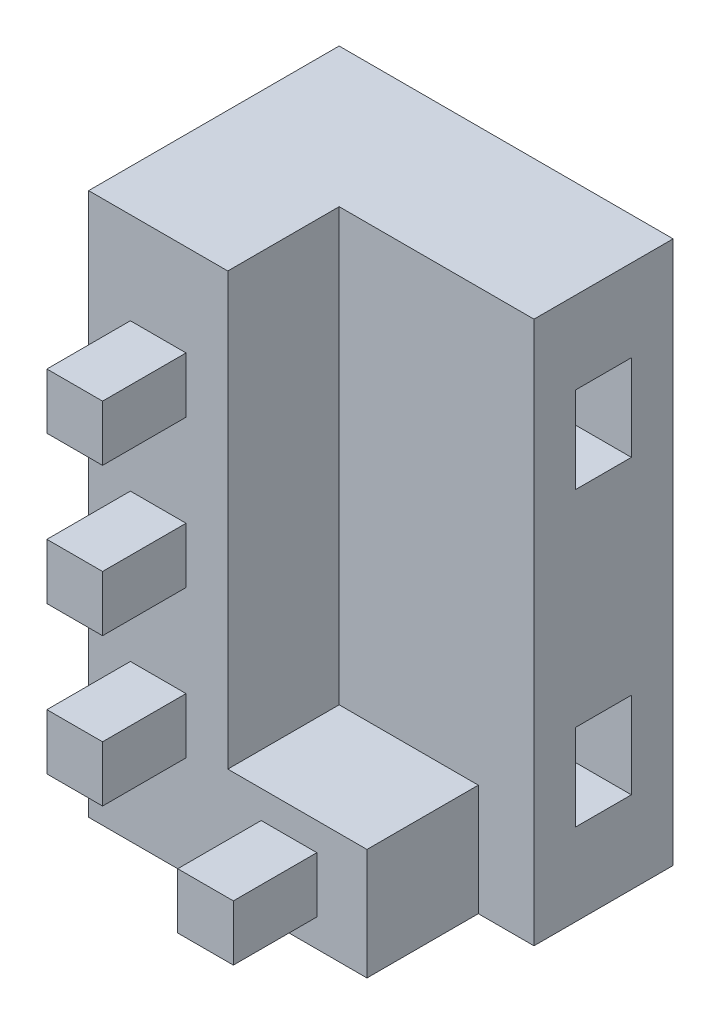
from build123d import *

# Parameters (mm, degrees)
SKETCH1_W                = 50
SKETCH1_H                = 150
BOSS_EXTRUDE1_DEPTH      = 250
SKETCH2_R                = 52.5
CUT_EXTRUDE1_DEPTH       = 15
BOSS_EXTRUDE2_DEPTH      = 150
BOSS_EXTRUDE3_DEPTH      = 175
SKETCH10_W               = 49.988184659
SKETCH10_H               = 250
BOSS_EXTRUDE4_DEPTH      = 200
CUT_EXTRUDE4_DEPTH       = 471.132959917
SKETCH12_W               = 200
SKETCH12_H               = 49.988184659
CUT_EXTRUDE5_DEPTH       = 55
CUT_EXTRUDE8_DEPTH       = 20
SKETCH17_W               = 12.5
SKETCH17_H               = 10.5
CUT_EXTRUDE9_DEPTH       = 9
SKETCH20_R               = 54.5
CUT_EXTRUDE10_DEPTH      = 10
SKETCH21_W               = 182.056865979
SKETCH21_H               = 55
CUT_EXTRUDE11_DEPTH      = 457.207189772
SKETCH24_W               = 16.5
SKETCH24_H               = 16.5
CUT_EXTRUDE13_DEPTH      = 50
SKETCH25_W               = 16.5
SKETCH25_H               = 22
CUT_EXTRUDE14_DEPTH      = 50
SKETCH26_W               = 16.5
SKETCH26_H               = 6.313729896
CUT_EXTRUDE15_DEPTH      = 50
CUT_EXTRUDE16_START      = -71.75
CUT_EXTRUDE16_DEPTH      = 29
SKETCH29_W               = 12.5
SKETCH29_H               = 10.8
CUT_EXTRUDE18_DEPTH      = 9
SKETCH30_W               = 40.672773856
SKETCH30_H               = 32.854304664
CUT_EXTRUDE19_DEPTH      = 50
SKETCH31_R               = 3.5
CUT_EXTRUDE20_DEPTH      = 20
CUT_EXTRUDE21_DEPTH      = 33
SKETCH33_R               = 63
SKETCH33_R_2             = 60
CUT_EXTRUDE22_DEPTH      = 20
CUT_EXTRUDE24_DEPTH      = 444.339599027
CUT_EXTRUDE24_DEPTH_BACK = 444.339599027
SKETCH34_W               = 192.037708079
SKETCH34_H               = 235
CUT_EXTRUDE25_DEPTH      = 444.339599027
CUT_EXTRUDE25_DEPTH_BACK = 444.339599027
SKETCH35_W               = 71
SKETCH35_H               = 90
SKETCH35_W_2             = 71.037708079
SKETCH35_H_2             = 40.011815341
BOSS_EXTRUDE5_START      = -155
SKETCH36_W               = 50
SKETCH36_H               = 40.011815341
BOSS_EXTRUDE5_DEPTH      = 40
SKETCH37_W               = 110
SKETCH37_H               = 15
BOSS_EXTRUDE6_DEPTH      = 40
CUT_EXTRUDE26_DEPTH      = 437.949653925
CUT_EXTRUDE26_DEPTH_BACK = 437.949653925
SKETCH38_R               = 5
SKETCH39_W               = 20
SKETCH39_H               = 20
BOSS_EXTRUDE7_DEPTH      = 30
CUT_EXTRUDE27_DEPTH      = 310.558805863
CUT_EXTRUDE27_DEPTH_BACK = 310.558805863
SKETCH40_W               = 130
SKETCH40_H               = 195
CUT_EXTRUDE28_DEPTH      = 21


with BuildPart() as part:
    # Sketch1 → Boss-Extrude1 (new body)
    with BuildSketch(Plane(origin=(0, 0, 0), x_dir=(1, 0, 0), z_dir=(0, 1, 0))):
        with Locations((5, 75)):
            Rectangle(SKETCH1_W, SKETCH1_H)
    extrude(amount=BOSS_EXTRUDE1_DEPTH)

    # Sketch2 → Cut-Extrude1 (cut)
    with BuildSketch(Plane(origin=(30, 0, 0), x_dir=(0, 0, -1), z_dir=(1, 0, 0))):
        with Locations((75, 175)):
            Circle(SKETCH2_R)
    extrude(amount=-CUT_EXTRUDE1_DEPTH, mode=Mode.SUBTRACT)

    # Sketch4 → Boss-Extrude2 (add)
    with BuildSketch(Plane.XY):
        with BuildLine():
            Line((30, 0), (30, 62.5))
            ThreePointArc((30, 62.5), (53.728602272, 17.849160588), (101.037708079, 0))
            Line((101.037708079, 0), (30, 0))
        make_face()
        with BuildLine():
            Line((-20, 0), (-91, 0))
            ThreePointArc((-91, 0), (-43.705047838, 17.850934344), (-20, 62.5))
            Line((-20, 62.5), (-20, 0))
        make_face()
    extrude(amount=-BOSS_EXTRUDE2_DEPTH)

    # Sketch8 → Boss-Extrude3 (add)
    with BuildSketch(Plane(origin=(0, 0, -150), x_dir=(-1, 0, 0), z_dir=(0, 0, -1))):
        with BuildLine():
            Line((-30, 250), (-30, 62.5))
            ThreePointArc((-30, 62.5), (-53.728602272, 17.849160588), (-101.037708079, 0))
            Line((-101.037708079, 0), (91, 0))
            ThreePointArc((91, 0), (43.705047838, 17.850934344), (20, 62.5))
            Line((20, 62.5), (20, 250))
            Line((20, 250), (-30, 250))
        make_face()
    extrude(amount=BOSS_EXTRUDE3_DEPTH)

    # Sketch10 → Boss-Extrude4 (add)
    with BuildSketch(Plane(origin=(30, 0, 0), x_dir=(0, 0, -1), z_dir=(1, 0, 0))):
        with Locations((300.005907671, 125)):
            Rectangle(SKETCH10_W, SKETCH10_H)
    extrude(amount=BOSS_EXTRUDE4_DEPTH)

    # Sketch11 → Cut-Extrude4 (cut, through all)
    with BuildSketch(Plane(origin=(0, 0, -325), x_dir=(-1, 0, 0), z_dir=(0, 0, -1))):
        Polygon((-166.5, 175), (-135.5, 175), (-135.5, 154), (-197.5, 154), (-197.5, 175), align=None)
    extrude(amount=-CUT_EXTRUDE4_DEPTH, mode=Mode.SUBTRACT)

    # Sketch12 → Cut-Extrude5 (cut)
    with BuildSketch(Plane(origin=(0, 250, 0), x_dir=(1, 0, 0), z_dir=(0, 1, 0))):
        with Locations((130, 300.005907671)):
            Rectangle(SKETCH12_W, SKETCH12_H)
    extrude(amount=-CUT_EXTRUDE5_DEPTH, mode=Mode.SUBTRACT)

    # Sketch16 → Cut-Extrude8 (cut)
    with BuildSketch(Plane(origin=(15, 0, 0), x_dir=(0, 0, -1), z_dir=(1, 0, 0))):
        with BuildLine():
            Line((71.75, 180), (78.25, 180))
            add(Edge.make_bspline(
                [(78.25, 170), (84.285140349, 175), (78.25, 180)],
                knots=[0, 0, 0, 1, 1, 1], degree=2))
            Line((78.25, 170), (71.75, 170))
            add(Edge.make_bspline(
                [(71.75, 180), (66.057994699, 175), (71.75, 170)],
                knots=[0, 0, 0, 1, 1, 1], degree=2))
        make_face()
    extrude(amount=-CUT_EXTRUDE8_DEPTH, mode=Mode.SUBTRACT)

    # Sketch17 → Cut-Extrude9 (cut)
    with BuildSketch(Plane(origin=(15, 0, 0), x_dir=(0, 0, -1), z_dir=(1, 0, 0))):
        with Locations((75.068297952, 175)):
            Rectangle(SKETCH17_W, SKETCH17_H)
    extrude(amount=-CUT_EXTRUDE9_DEPTH, mode=Mode.SUBTRACT)

    # Sketch20 → Cut-Extrude10 (cut)
    with BuildSketch(Plane(origin=(30, 0, 0), x_dir=(0, 0, -1), z_dir=(1, 0, 0))):
        with Locations((75, 175)):
            Circle(SKETCH20_R)
    extrude(amount=-CUT_EXTRUDE10_DEPTH, mode=Mode.SUBTRACT)

    # Sketch21 → Cut-Extrude11 (cut, through all)
    with BuildSketch(Plane(origin=(30, 0, 0), x_dir=(0, 0, -1), z_dir=(1, 0, 0))):
        with Locations((233.97156701, 222.5)):
            Rectangle(SKETCH21_W, SKETCH21_H)
    extrude(amount=-CUT_EXTRUDE11_DEPTH, mode=Mode.SUBTRACT)

    # Sketch24 → Cut-Extrude13 (cut)
    with BuildSketch(Plane.XY.offset(-275.011815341)):
        with Locations((166.5, 145.75)):
            Rectangle(SKETCH24_W, SKETCH24_H)
    extrude(amount=-CUT_EXTRUDE13_DEPTH, mode=Mode.SUBTRACT)

    # Sketch25 → Cut-Extrude14 (cut)
    with BuildSketch(Plane.XY.offset(-275.011815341)):
        with Locations((166.5, 120.186270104)):
            Rectangle(SKETCH25_W, SKETCH25_H)
    extrude(amount=-CUT_EXTRUDE14_DEPTH, mode=Mode.SUBTRACT)

    # Sketch26 → Cut-Extrude15 (cut)
    with BuildSketch(Plane.XY.offset(-275.011815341)):
        with Locations((166.5, 134.343135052)):
            Rectangle(SKETCH26_W, SKETCH26_H)
    extrude(amount=-CUT_EXTRUDE15_DEPTH, mode=Mode.SUBTRACT)

    # Sketch27 → Cut-Extrude16 (cut)
    with BuildSketch(Plane(origin=(230, 0, 0), x_dir=(0, 0, -1), z_dir=(1, 0, 0)).offset(CUT_EXTRUDE16_START)):
        with BuildLine():
            Line((291.501152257, 135.600374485), (298.001152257, 135.600374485))
            add(Edge.make_bspline(
                [(298.001152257, 125.100374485), (303.344461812, 129.957776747), (298.001152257, 135.600374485)],
                knots=[0, 0, 0, 1, 1, 1], degree=2))
            Line((298.001152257, 125.100374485), (291.501152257, 125.100374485))
            add(Edge.make_bspline(
                [(291.501152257, 135.600374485), (285.456075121, 129.957776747), (291.501152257, 125.100374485)],
                knots=[0, 0, 0, 1, 1, 1], degree=2))
        make_face()
    extrude(amount=-CUT_EXTRUDE16_DEPTH, mode=Mode.SUBTRACT)

    # Sketch29 → Cut-Extrude18 (cut)
    with BuildSketch(Plane(origin=(158.25, 0, 0), x_dir=(0, 0, -1), z_dir=(1, 0, 0))):
        with Locations((294.570111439, 130.32325265)):
            Rectangle(SKETCH29_W, SKETCH29_H)
        with BuildLine():
            Line((298.001152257, 135.600374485), (291.501152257, 135.600374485))
            add(Edge.make_bspline(
                [(291.501152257, 135.600374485), (285.456075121, 129.957776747), (291.501152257, 125.100374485)],
                knots=[0, 0, 0, 1, 1, 1], degree=2))
            Line((291.501152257, 125.100374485), (298.001152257, 125.100374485))
            add(Edge.make_bspline(
                [(298.001152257, 125.100374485), (303.344461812, 129.957776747), (298.001152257, 135.600374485)],
                knots=[0, 0, 0, 1, 1, 1], degree=2))
        make_face(mode=Mode.SUBTRACT)
    extrude(amount=-CUT_EXTRUDE18_DEPTH, mode=Mode.SUBTRACT)

    # Sketch30 → Cut-Extrude19 (cut)
    with BuildSketch(Plane.XY.offset(-275.011815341)):
        with Locations((178.586386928, 125.602490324)):
            Rectangle(SKETCH30_W, SKETCH30_H)
    extrude(amount=-CUT_EXTRUDE19_DEPTH, mode=Mode.SUBTRACT)

    # Sketch31 → Cut-Extrude20 (cut)
    with BuildSketch(Plane(origin=(-5, 0, 0), x_dir=(0, 0, -1), z_dir=(1, 0, 0))):
        with Locations((74.950457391, 175.071160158)):
            Circle(SKETCH31_R)
    extrude(amount=-CUT_EXTRUDE20_DEPTH, mode=Mode.SUBTRACT)

    # Sketch32 → Cut-Extrude21 (cut)
    with BuildSketch(Plane(origin=(0, 0, -325), x_dir=(-1, 0, 0), z_dir=(0, 0, -1))):
        with BuildLine():
            ThreePointArc((-128.116356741, 129.990231), (-128.41227742, 131.398732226), (-129.25, 132.569059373))
            Line((-129.25, 132.569059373), (-129.25, 127.411402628))
            ThreePointArc((-129.25, 127.411402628), (-128.41227742, 128.581729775), (-128.116356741, 129.990231))
        make_face()
        with BuildLine():
            Line((-129.25, 127.411402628), (-129.25, 132.569059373))
            ThreePointArc((-129.25, 132.569059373), (-135.116356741, 129.990231), (-129.25, 127.411402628))
        make_face()
    extrude(amount=-CUT_EXTRUDE21_DEPTH, mode=Mode.SUBTRACT)

    # Sketch33 → Cut-Extrude22 (cut)
    with BuildSketch(Plane(origin=(30, 0, 0), x_dir=(0, 0, -1), z_dir=(1, 0, 0))):
        with Locations((74.950457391, 175.071160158)):
            Circle(SKETCH33_R)
        with Locations((74.950457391, 175.071160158)):
            Circle(SKETCH33_R_2, mode=Mode.SUBTRACT)
    extrude(amount=-CUT_EXTRUDE22_DEPTH, mode=Mode.SUBTRACT)

    # Sketch34 → Cut-Extrude24 (cut, two sides: drawn at the far end of the back side and taken through both)
    with BuildSketch(Plane(origin=(0, 195, 0), x_dir=(1, 0, 0), z_dir=(0, 1, 0)).offset(-CUT_EXTRUDE24_DEPTH_BACK)):
        with Locations((5.01885404, 117.5)):
            Rectangle(SKETCH34_W, SKETCH34_H)
    extrude(amount=CUT_EXTRUDE24_DEPTH + CUT_EXTRUDE24_DEPTH_BACK, mode=Mode.SUBTRACT)

    # Sketch35 → Cut-Extrude25 (cut, two sides: drawn at the far end of the back side and taken through both)
    with BuildSketch(Plane(origin=(0, 195, 0), x_dir=(1, 0, 0), z_dir=(0, 1, 0)).offset(-CUT_EXTRUDE25_DEPTH_BACK)):
        with Locations((-55.5, 280)):
            Rectangle(SKETCH35_W, SKETCH35_H)
        with Locations((65.51885404, 255.005907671)):
            Rectangle(SKETCH35_W_2, SKETCH35_H_2)
    extrude(amount=CUT_EXTRUDE25_DEPTH + CUT_EXTRUDE25_DEPTH_BACK, mode=Mode.SUBTRACT)

    # Sketch36 → Boss-Extrude5 (add)
    with BuildSketch(Plane(origin=(0, 195, 0), x_dir=(1, 0, 0), z_dir=(0, 1, 0)).offset(BOSS_EXTRUDE5_START)):
        with Locations((55, 255.005907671)):
            Rectangle(SKETCH36_W, SKETCH36_H)
    extrude(amount=-BOSS_EXTRUDE5_DEPTH)

    # Sketch37 → Boss-Extrude6 (add)
    with BuildSketch(Plane.XY.offset(-275.011815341)):
        with Locations((175, 7.5)):
            Rectangle(SKETCH37_W, SKETCH37_H)
    extrude(amount=BOSS_EXTRUDE6_DEPTH)

    # Sketch38 → Cut-Extrude26 (cut, two sides: drawn at the far end of the back side and taken through both)
    with BuildSketch(Plane(origin=(0, 15, 0), x_dir=(1, 0, 0), z_dir=(0, 1, 0)).offset(-CUT_EXTRUDE26_DEPTH_BACK)):
        with Locations(Location((145, 255.011815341, 0), (0, 0, 180))):
            Circle(SKETCH38_R)
        with Locations(Location((205, 255.011815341, 0), (0, 0, 180))):
            Circle(SKETCH38_R)
    extrude(amount=CUT_EXTRUDE26_DEPTH + CUT_EXTRUDE26_DEPTH_BACK, mode=Mode.SUBTRACT)

    # Sketch39 → Boss-Extrude7 (add)
    with BuildSketch(Plane.XY.offset(-235)):
        with Locations((5, 152)):
            Rectangle(SKETCH39_W, SKETCH39_H)
        with Locations((5, 99)):
            Rectangle(SKETCH39_W, SKETCH39_H)
        with Locations((5, 46)):
            Rectangle(SKETCH39_W, SKETCH39_H)
        with Locations((52, 20)):
            Rectangle(SKETCH39_W, SKETCH39_H)
    extrude(amount=BOSS_EXTRUDE7_DEPTH)

    # Sketch40 → Cut-Extrude27 (cut, two sides: drawn at the far end of the back side and taken through both)
    with BuildSketch(Plane.XY.offset(-275.011815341).offset(-CUT_EXTRUDE27_DEPTH_BACK)):
        with Locations((165, 97.5)):
            Rectangle(SKETCH40_W, SKETCH40_H)
    extrude(amount=CUT_EXTRUDE27_DEPTH + CUT_EXTRUDE27_DEPTH_BACK, mode=Mode.SUBTRACT)

    # Sketch41 → Cut-Extrude28 (cut)
    with BuildSketch(Plane(origin=(100, 0, 0), x_dir=(0, 0, -1), z_dir=(1, 0, 0))):
        Polygon((300.00590767, 134.5), (310.00590767, 134.5), (310.00590767, 165.5), (300.00590767, 165.5), (290.00590767, 165.5), (290.00590767, 134.5), align=None)
        Polygon((300.00590767, 29.5), (310.00590767, 29.5), (310.00590767, 60.5), (290.00590767, 60.5), (290.00590767, 29.5), align=None)
    extrude(amount=-CUT_EXTRUDE28_DEPTH, mode=Mode.SUBTRACT)


solid = part.part
